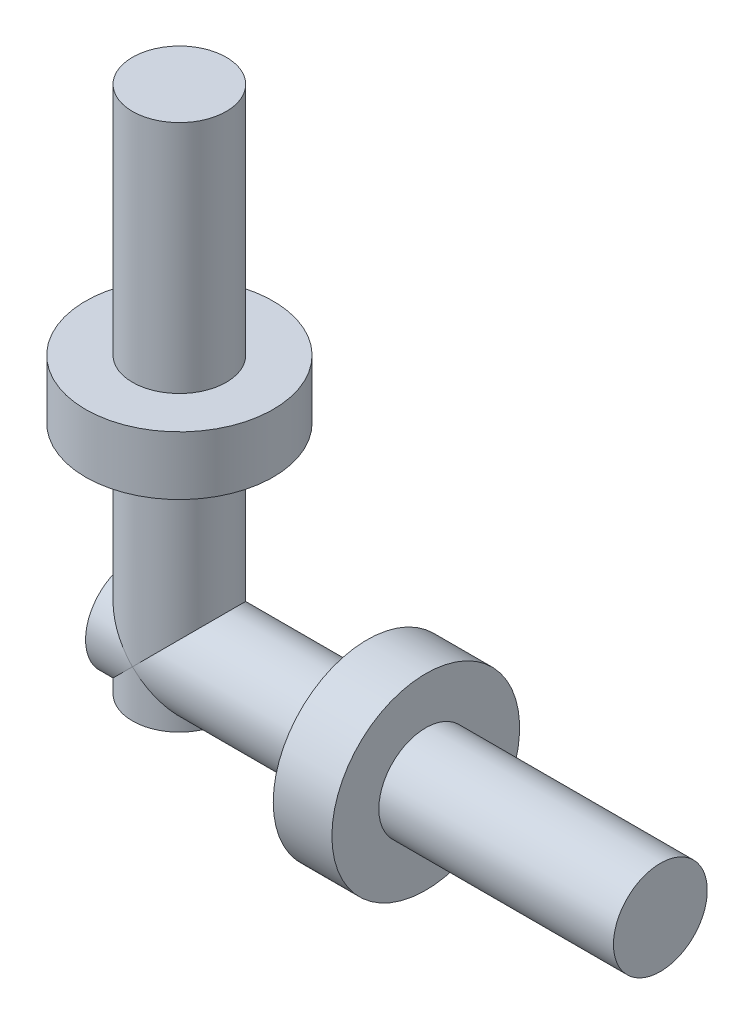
from build123d import *

# Parameters (mm, degrees)
SKETCH_1_R               = 4
EXTRUDE_1_DEPTH          = 2.5
SKETCH_2_R               = 2
EXTRUDE_2_DEPTH          = 10
EXTRUDE_START            = 10
SKETCH_3_R               = 2
EXTRUDE_3_DEPTH          = 10
MIRROR_4_COPY_1_SKETCH_R = 4
MIRROR_4_COPY_1_DEPTH    = 2.5
MIRROR_4_COPY_2_SKETCH_R = 4
MIRROR_4_COPY_2_DEPTH    = 2.5


with BuildPart() as part:
    # Sketch 1 → Extrude 1 (new body)
    with BuildSketch(Plane(origin=(0, 0, 0), x_dir=(1, 0, 0), z_dir=(0, 1, 0))):
        with Locations(Location((0, 0, 0), (0, 0, 270))):
            Circle(SKETCH_1_R)
    extrude_1 = extrude(amount=EXTRUDE_1_DEPTH)

    # Sketch 2 → Extrude 2 (add)
    with BuildSketch(Plane(origin=(0, 2.5, 0), x_dir=(1, 0, 0), z_dir=(0, 1, 0))):
        with Locations(Location((0, 0, 0), (0, 0, 270))):
            Circle(SKETCH_2_R)
    extrude_2 = extrude(amount=EXTRUDE_2_DEPTH)

    # Sketch 3 → Extrude 3 (add)
    with BuildSketch(Plane.XZ.offset(EXTRUDE_START)):
        with Locations(Location((0, 0, 0), (0, 0, 90))):
            Circle(SKETCH_3_R)
    extrude_3 = extrude(amount=-EXTRUDE_3_DEPTH)

    # Mirror 1: Extrude 3 across plane
    add(extrude_3.mirror(Plane(origin=(4, -4, 0), x_dir=(0, 0, 1), z_dir=(0.7071067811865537, -0.7071067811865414, 0))))

    # Mirror 3: Extrude 1 across plane
    add(extrude_1.mirror(Plane(origin=(4, -4, 0), x_dir=(0, 0, 1), z_dir=(0.7071067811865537, -0.7071067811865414, 0))))

    # Mirror 4: Extrude 2 across plane
    add(extrude_2.mirror(Plane(origin=(4, -4, 0), x_dir=(0, 0, 1), z_dir=(0.7071067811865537, -0.7071067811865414, 0))))

    # Mirror 4 copy 1 sketch → Mirror 4 copy 1 (add)
    with BuildSketch(Plane(origin=(0, 0, 0), x_dir=(1, 0, 0), z_dir=(0, 1, 0))):
        with Locations(Location((0, 0, 0), (0, 0, 270))):
            Circle(MIRROR_4_COPY_1_SKETCH_R)
    extrude(amount=MIRROR_4_COPY_1_DEPTH)

    # Mirror 4 copy 2 sketch → Mirror 4 copy 2 (add)
    with BuildSketch(Plane(origin=(8, -8, 0), x_dir=(0, 1, 0), z_dir=(1, 0, 0))):
        Circle(MIRROR_4_COPY_2_SKETCH_R)
    extrude(amount=MIRROR_4_COPY_2_DEPTH)


solid = part.part
